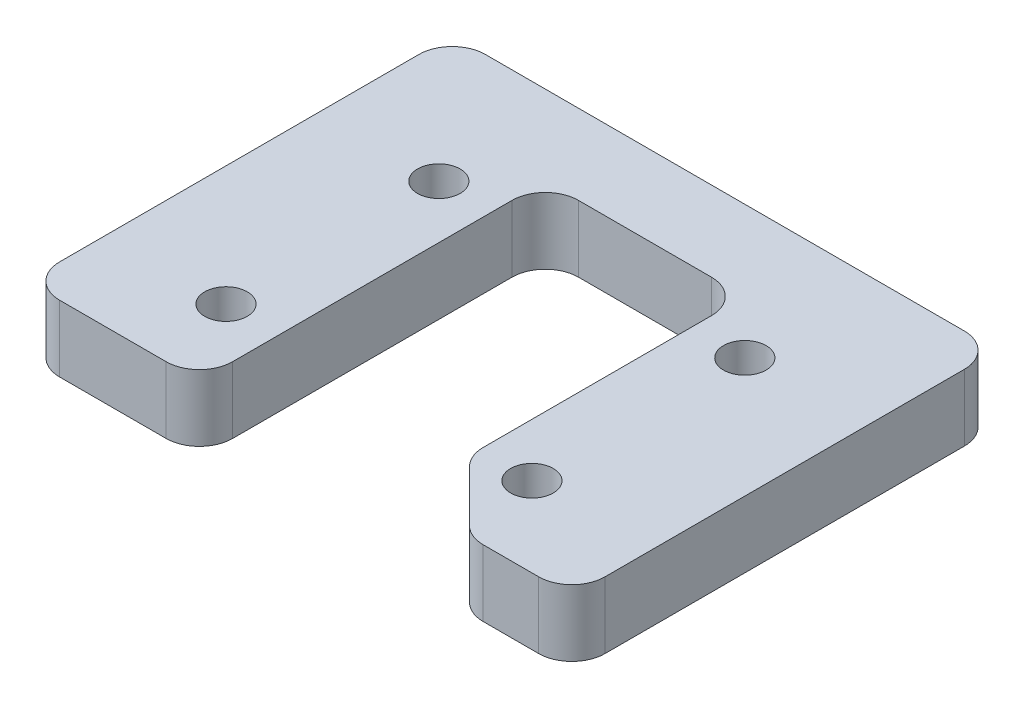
ISO-10303-21;
HEADER;
FILE_DESCRIPTION(('STEP AP214'),'2;1');
FILE_NAME('part.step','',(''),(''),'','','');
FILE_SCHEMA(('AUTOMOTIVE_DESIGN { 1 0 10303 214 1 1 1 1 }'));
ENDSEC;
DATA;
#1=APPLICATION_CONTEXT('core data for automotive mechanical design processes');
#2=APPLICATION_PROTOCOL_DEFINITION('international standard','automotive_design',2000,#1);
#3=PRODUCT_CONTEXT('',#1,'mechanical');
#4=PRODUCT('Part','Part','',(#3));
#5=PRODUCT_RELATED_PRODUCT_CATEGORY('part','',(#4));
#6=PRODUCT_DEFINITION_FORMATION('','',#4);
#7=PRODUCT_DEFINITION_CONTEXT('part definition',#1,'design');
#8=PRODUCT_DEFINITION('design','',#6,#7);
#9=PRODUCT_DEFINITION_SHAPE('','',#8);
#10=(LENGTH_UNIT() NAMED_UNIT(*) SI_UNIT(.MILLI.,.METRE.));
#11=(NAMED_UNIT(*) PLANE_ANGLE_UNIT() SI_UNIT($,.RADIAN.));
#12=(NAMED_UNIT(*) SI_UNIT($,.STERADIAN.) SOLID_ANGLE_UNIT());
#13=UNCERTAINTY_MEASURE_WITH_UNIT(LENGTH_MEASURE(1.E-05),#10,'distance_accuracy_value','');
#14=(GEOMETRIC_REPRESENTATION_CONTEXT(3) GLOBAL_UNCERTAINTY_ASSIGNED_CONTEXT((#13)) GLOBAL_UNIT_ASSIGNED_CONTEXT((#10,
#11,#12)) REPRESENTATION_CONTEXT('',''));
#15=CARTESIAN_POINT('',(0.,0.,0.));
#16=DIRECTION('',(0.,0.,1.));
#17=DIRECTION('',(1.,0.,0.));
#18=AXIS2_PLACEMENT_3D('',#15,#16,#17);
#19=CARTESIAN_POINT('',(-41.,10.,32.));
#20=DIRECTION('',(0.,0.,-1.));
#21=DIRECTION('',(-1.,0.,0.));
#22=AXIS2_PLACEMENT_3D('',#19,#20,#21);
#23=PLANE('',#22);
#24=DIRECTION('',(1.,0.,0.));
#25=VECTOR('',#24,1.);
#26=CARTESIAN_POINT('',(-41.,10.,32.));
#27=LINE('',#26,#25);
#28=CARTESIAN_POINT('',(-36.,10.,32.));
#29=VERTEX_POINT('',#28);
#30=CARTESIAN_POINT('',(-20.,10.,32.));
#31=VERTEX_POINT('',#30);
#32=EDGE_CURVE('E206',#29,#31,#27,.T.);
#33=ORIENTED_EDGE('',*,*,#32,.F.);
#34=DIRECTION('',(0.,-1.,0.));
#35=VECTOR('',#34,1.);
#36=CARTESIAN_POINT('',(-36.,10.,32.));
#37=LINE('',#36,#35);
#38=CARTESIAN_POINT('',(-36.,0.,32.));
#39=VERTEX_POINT('',#38);
#40=EDGE_CURVE('E168',#29,#39,#37,.T.);
#41=ORIENTED_EDGE('',*,*,#40,.T.);
#42=DIRECTION('',(1.,0.,0.));
#43=VECTOR('',#42,1.);
#44=CARTESIAN_POINT('',(-41.,0.,32.));
#45=LINE('',#44,#43);
#46=CARTESIAN_POINT('',(-20.,0.,32.));
#47=VERTEX_POINT('',#46);
#48=EDGE_CURVE('E199',#39,#47,#45,.T.);
#49=ORIENTED_EDGE('',*,*,#48,.T.);
#50=DIRECTION('',(0.,1.,0.));
#51=VECTOR('',#50,1.);
#52=CARTESIAN_POINT('',(-20.,10.,32.));
#53=LINE('',#52,#51);
#54=EDGE_CURVE('E277',#47,#31,#53,.T.);
#55=ORIENTED_EDGE('',*,*,#54,.T.);
#56=EDGE_LOOP('',(#33,#41,#49,#55));
#57=FACE_BOUND('',#56,.T.);
#58=ADVANCED_FACE('F32',(#57),#23,.F.);
#59=CARTESIAN_POINT('',(41.,10.,-32.));
#60=DIRECTION('',(-1.,0.,0.));
#61=DIRECTION('',(0.,0.,1.));
#62=AXIS2_PLACEMENT_3D('',#59,#60,#61);
#63=PLANE('',#62);
#64=DIRECTION('',(0.,0.,-1.));
#65=VECTOR('',#64,1.);
#66=CARTESIAN_POINT('',(41.,10.,-32.));
#67=LINE('',#66,#65);
#68=CARTESIAN_POINT('',(41.,10.,27.));
#69=VERTEX_POINT('',#68);
#70=CARTESIAN_POINT('',(41.,10.,-27.));
#71=VERTEX_POINT('',#70);
#72=EDGE_CURVE('E195',#69,#71,#67,.T.);
#73=ORIENTED_EDGE('',*,*,#72,.F.);
#74=DIRECTION('',(0.,-1.,0.));
#75=VECTOR('',#74,1.);
#76=CARTESIAN_POINT('',(41.,10.,27.));
#77=LINE('',#76,#75);
#78=CARTESIAN_POINT('',(41.,0.,27.));
#79=VERTEX_POINT('',#78);
#80=EDGE_CURVE('E264',#69,#79,#77,.T.);
#81=ORIENTED_EDGE('',*,*,#80,.T.);
#82=DIRECTION('',(0.,0.,-1.));
#83=VECTOR('',#82,1.);
#84=CARTESIAN_POINT('',(41.,0.,-32.));
#85=LINE('',#84,#83);
#86=CARTESIAN_POINT('',(41.,0.,-27.));
#87=VERTEX_POINT('',#86);
#88=EDGE_CURVE('E208',#79,#87,#85,.T.);
#89=ORIENTED_EDGE('',*,*,#88,.T.);
#90=DIRECTION('',(0.,-1.,0.));
#91=VECTOR('',#90,1.);
#92=CARTESIAN_POINT('',(41.,10.,-27.));
#93=LINE('',#92,#91);
#94=EDGE_CURVE('E262',#87,#71,#93,.F.);
#95=ORIENTED_EDGE('',*,*,#94,.T.);
#96=EDGE_LOOP('',(#73,#81,#89,#95));
#97=FACE_BOUND('',#96,.T.);
#98=ADVANCED_FACE('F370',(#97),#63,.F.);
#99=CARTESIAN_POINT('',(-41.,10.,-32.));
#100=DIRECTION('',(0.,0.,1.));
#101=DIRECTION('',(1.,0.,0.));
#102=AXIS2_PLACEMENT_3D('',#99,#100,#101);
#103=PLANE('',#102);
#104=DIRECTION('',(-1.,0.,0.));
#105=VECTOR('',#104,1.);
#106=CARTESIAN_POINT('',(-41.,10.,-32.));
#107=LINE('',#106,#105);
#108=CARTESIAN_POINT('',(36.,10.,-32.));
#109=VERTEX_POINT('',#108);
#110=CARTESIAN_POINT('',(-36.,10.,-32.));
#111=VERTEX_POINT('',#110);
#112=EDGE_CURVE('E198',#109,#111,#107,.T.);
#113=ORIENTED_EDGE('',*,*,#112,.F.);
#114=DIRECTION('',(0.,-1.,0.));
#115=VECTOR('',#114,1.);
#116=CARTESIAN_POINT('',(36.,10.,-32.));
#117=LINE('',#116,#115);
#118=CARTESIAN_POINT('',(36.,0.,-32.));
#119=VERTEX_POINT('',#118);
#120=EDGE_CURVE('E269',#109,#119,#117,.T.);
#121=ORIENTED_EDGE('',*,*,#120,.T.);
#122=DIRECTION('',(-1.,0.,0.));
#123=VECTOR('',#122,1.);
#124=CARTESIAN_POINT('',(-41.,0.,-32.));
#125=LINE('',#124,#123);
#126=CARTESIAN_POINT('',(-36.,0.,-32.));
#127=VERTEX_POINT('',#126);
#128=EDGE_CURVE('E211',#119,#127,#125,.T.);
#129=ORIENTED_EDGE('',*,*,#128,.T.);
#130=DIRECTION('',(0.,-1.,0.));
#131=VECTOR('',#130,1.);
#132=CARTESIAN_POINT('',(-36.,10.,-32.));
#133=LINE('',#132,#131);
#134=EDGE_CURVE('E267',#127,#111,#133,.F.);
#135=ORIENTED_EDGE('',*,*,#134,.T.);
#136=EDGE_LOOP('',(#113,#121,#129,#135));
#137=FACE_BOUND('',#136,.T.);
#138=ADVANCED_FACE('F376',(#137),#103,.F.);
#139=CARTESIAN_POINT('',(-41.,10.,-32.));
#140=DIRECTION('',(1.,0.,0.));
#141=DIRECTION('',(0.,0.,-1.));
#142=AXIS2_PLACEMENT_3D('',#139,#140,#141);
#143=PLANE('',#142);
#144=DIRECTION('',(0.,0.,1.));
#145=VECTOR('',#144,1.);
#146=CARTESIAN_POINT('',(-41.,10.,-32.));
#147=LINE('',#146,#145);
#148=CARTESIAN_POINT('',(-41.,10.,-27.));
#149=VERTEX_POINT('',#148);
#150=CARTESIAN_POINT('',(-41.,10.,27.));
#151=VERTEX_POINT('',#150);
#152=EDGE_CURVE('E202',#149,#151,#147,.T.);
#153=ORIENTED_EDGE('',*,*,#152,.F.);
#154=DIRECTION('',(0.,-1.,0.));
#155=VECTOR('',#154,1.);
#156=CARTESIAN_POINT('',(-41.,10.,-27.));
#157=LINE('',#156,#155);
#158=CARTESIAN_POINT('',(-41.,0.,-27.));
#159=VERTEX_POINT('',#158);
#160=EDGE_CURVE('E274',#149,#159,#157,.T.);
#161=ORIENTED_EDGE('',*,*,#160,.T.);
#162=DIRECTION('',(0.,0.,1.));
#163=VECTOR('',#162,1.);
#164=CARTESIAN_POINT('',(-41.,0.,-32.));
#165=LINE('',#164,#163);
#166=CARTESIAN_POINT('',(-41.,0.,27.));
#167=VERTEX_POINT('',#166);
#168=EDGE_CURVE('E214',#159,#167,#165,.T.);
#169=ORIENTED_EDGE('',*,*,#168,.T.);
#170=DIRECTION('',(0.,-1.,0.));
#171=VECTOR('',#170,1.);
#172=CARTESIAN_POINT('',(-41.,10.,27.));
#173=LINE('',#172,#171);
#174=EDGE_CURVE('E272',#167,#151,#173,.F.);
#175=ORIENTED_EDGE('',*,*,#174,.T.);
#176=EDGE_LOOP('',(#153,#161,#169,#175));
#177=FACE_BOUND('',#176,.T.);
#178=ADVANCED_FACE('F383',(#177),#143,.F.);
#179=CARTESIAN_POINT('',(27.6776695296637,10.,32.));
#180=VERTEX_POINT('',#179);
#181=CARTESIAN_POINT('',(36.,10.,32.));
#182=VERTEX_POINT('',#181);
#183=EDGE_CURVE('E205',#180,#182,#27,.T.);
#184=ORIENTED_EDGE('',*,*,#183,.F.);
#185=DIRECTION('',(0.,1.,0.));
#186=VECTOR('',#185,1.);
#187=CARTESIAN_POINT('',(27.6776695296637,10.,32.));
#188=LINE('',#187,#186);
#189=CARTESIAN_POINT('',(27.6776695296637,0.,32.));
#190=VERTEX_POINT('',#189);
#191=EDGE_CURVE('E54',#180,#190,#188,.F.);
#192=ORIENTED_EDGE('',*,*,#191,.T.);
#193=CARTESIAN_POINT('',(36.,0.,32.));
#194=VERTEX_POINT('',#193);
#195=EDGE_CURVE('E217',#190,#194,#45,.T.);
#196=ORIENTED_EDGE('',*,*,#195,.T.);
#197=DIRECTION('',(0.,-1.,0.));
#198=VECTOR('',#197,1.);
#199=CARTESIAN_POINT('',(36.,10.,32.));
#200=LINE('',#199,#198);
#201=EDGE_CURVE('E259',#194,#182,#200,.F.);
#202=ORIENTED_EDGE('',*,*,#201,.T.);
#203=EDGE_LOOP('',(#184,#192,#196,#202));
#204=FACE_BOUND('',#203,.T.);
#205=ADVANCED_FACE('F347',(#204),#23,.F.);
#206=CARTESIAN_POINT('',(41.,10.,32.));
#207=DIRECTION('',(0.,1.,0.));
#208=DIRECTION('',(0.,0.,1.));
#209=AXIS2_PLACEMENT_3D('',#206,#207,#208);
#210=PLANE('',#209);
#211=CARTESIAN_POINT('',(23.,10.,-12.));
#212=DIRECTION('',(0.,1.,0.));
#213=DIRECTION('',(0.,0.,1.));
#214=AXIS2_PLACEMENT_3D('',#211,#212,#213);
#215=CIRCLE('',#214,3.2);
#216=CARTESIAN_POINT('',(23.,10.,-8.8));
#217=VERTEX_POINT('',#216);
#218=EDGE_CURVE('E330',#217,#217,#215,.T.);
#219=ORIENTED_EDGE('',*,*,#218,.F.);
#220=EDGE_LOOP('',(#219));
#221=FACE_BOUND('',#220,.T.);
#222=CARTESIAN_POINT('',(23.,10.,20.));
#223=DIRECTION('',(0.,1.,0.));
#224=DIRECTION('',(0.,0.,1.));
#225=AXIS2_PLACEMENT_3D('',#222,#223,#224);
#226=CIRCLE('',#225,3.2);
#227=CARTESIAN_POINT('',(23.,10.,23.2));
#228=VERTEX_POINT('',#227);
#229=EDGE_CURVE('E324',#228,#228,#226,.T.);
#230=ORIENTED_EDGE('',*,*,#229,.F.);
#231=EDGE_LOOP('',(#230));
#232=FACE_BOUND('',#231,.T.);
#233=CARTESIAN_POINT('',(-23.,10.,20.));
#234=DIRECTION('',(0.,1.,0.));
#235=DIRECTION('',(0.,0.,1.));
#236=AXIS2_PLACEMENT_3D('',#233,#234,#235);
#237=CIRCLE('',#236,3.2);
#238=CARTESIAN_POINT('',(-23.,10.,23.2));
#239=VERTEX_POINT('',#238);
#240=EDGE_CURVE('E318',#239,#239,#237,.T.);
#241=ORIENTED_EDGE('',*,*,#240,.F.);
#242=EDGE_LOOP('',(#241));
#243=FACE_BOUND('',#242,.T.);
#244=CARTESIAN_POINT('',(-23.,10.,-12.));
#245=DIRECTION('',(0.,1.,0.));
#246=DIRECTION('',(0.,0.,1.));
#247=AXIS2_PLACEMENT_3D('',#244,#245,#246);
#248=CIRCLE('',#247,3.2);
#249=CARTESIAN_POINT('',(-23.,10.,-8.8));
#250=VERTEX_POINT('',#249);
#251=EDGE_CURVE('E310',#250,#250,#248,.T.);
#252=ORIENTED_EDGE('',*,*,#251,.F.);
#253=EDGE_LOOP('',(#252));
#254=FACE_BOUND('',#253,.T.);
#255=DIRECTION('',(0.,0.,-1.));
#256=VECTOR('',#255,1.);
#257=CARTESIAN_POINT('',(15.,10.,-20.));
#258=LINE('',#257,#256);
#259=CARTESIAN_POINT('',(15.,10.,19.3223304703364));
#260=VERTEX_POINT('',#259);
#261=CARTESIAN_POINT('',(15.,10.,-15.));
#262=VERTEX_POINT('',#261);
#263=EDGE_CURVE('E191',#260,#262,#258,.T.);
#264=ORIENTED_EDGE('',*,*,#263,.F.);
#265=CARTESIAN_POINT('',(20.,10.,19.3223304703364));
#266=DIRECTION('',(0.,1.,0.));
#267=DIRECTION('',(0.,0.,1.));
#268=AXIS2_PLACEMENT_3D('',#265,#266,#267);
#269=CIRCLE('',#268,5.);
#270=CARTESIAN_POINT('',(16.4644660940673,10.,22.8578643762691));
#271=VERTEX_POINT('',#270);
#272=EDGE_CURVE('E239',#260,#271,#269,.T.);
#273=ORIENTED_EDGE('',*,*,#272,.T.);
#274=DIRECTION('',(-0.707106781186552,0.,-0.707106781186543));
#275=VECTOR('',#274,1.);
#276=CARTESIAN_POINT('',(15.,10.,21.3933982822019));
#277=LINE('',#276,#275);
#278=CARTESIAN_POINT('',(24.142135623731,10.,30.5355339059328));
#279=VERTEX_POINT('',#278);
#280=EDGE_CURVE('E291',#279,#271,#277,.T.);
#281=ORIENTED_EDGE('',*,*,#280,.F.);
#282=CARTESIAN_POINT('',(27.6776695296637,10.,27.));
#283=DIRECTION('',(0.,1.,0.));
#284=DIRECTION('',(0.,0.,1.));
#285=AXIS2_PLACEMENT_3D('',#282,#283,#284);
#286=CIRCLE('',#285,5.);
#287=EDGE_CURVE('E237',#279,#180,#286,.T.);
#288=ORIENTED_EDGE('',*,*,#287,.T.);
#289=ORIENTED_EDGE('',*,*,#183,.T.);
#290=CARTESIAN_POINT('',(36.,10.,27.));
#291=DIRECTION('',(0.,1.,0.));
#292=DIRECTION('',(0.,0.,1.));
#293=AXIS2_PLACEMENT_3D('',#290,#291,#292);
#294=CIRCLE('',#293,5.);
#295=EDGE_CURVE('E235',#182,#69,#294,.T.);
#296=ORIENTED_EDGE('',*,*,#295,.T.);
#297=ORIENTED_EDGE('',*,*,#72,.T.);
#298=CARTESIAN_POINT('',(36.,10.,-27.));
#299=DIRECTION('',(0.,1.,0.));
#300=DIRECTION('',(0.,0.,1.));
#301=AXIS2_PLACEMENT_3D('',#298,#299,#300);
#302=CIRCLE('',#301,5.);
#303=EDGE_CURVE('E233',#71,#109,#302,.T.);
#304=ORIENTED_EDGE('',*,*,#303,.T.);
#305=ORIENTED_EDGE('',*,*,#112,.T.);
#306=CARTESIAN_POINT('',(-36.,10.,-27.));
#307=DIRECTION('',(0.,1.,0.));
#308=DIRECTION('',(0.,0.,1.));
#309=AXIS2_PLACEMENT_3D('',#306,#307,#308);
#310=CIRCLE('',#309,5.);
#311=EDGE_CURVE('E231',#111,#149,#310,.T.);
#312=ORIENTED_EDGE('',*,*,#311,.T.);
#313=ORIENTED_EDGE('',*,*,#152,.T.);
#314=CARTESIAN_POINT('',(-36.,10.,27.));
#315=DIRECTION('',(0.,1.,0.));
#316=DIRECTION('',(0.,0.,1.));
#317=AXIS2_PLACEMENT_3D('',#314,#315,#316);
#318=CIRCLE('',#317,5.);
#319=EDGE_CURVE('E229',#151,#29,#318,.T.);
#320=ORIENTED_EDGE('',*,*,#319,.T.);
#321=ORIENTED_EDGE('',*,*,#32,.T.);
#322=CARTESIAN_POINT('',(-20.,10.,27.));
#323=DIRECTION('',(0.,1.,0.));
#324=DIRECTION('',(0.,0.,1.));
#325=AXIS2_PLACEMENT_3D('',#322,#323,#324);
#326=CIRCLE('',#325,5.);
#327=CARTESIAN_POINT('',(-15.,10.,27.));
#328=VERTEX_POINT('',#327);
#329=EDGE_CURVE('E184',#31,#328,#326,.T.);
#330=ORIENTED_EDGE('',*,*,#329,.T.);
#331=DIRECTION('',(0.,0.,1.));
#332=VECTOR('',#331,1.);
#333=CARTESIAN_POINT('',(-15.,10.,-20.));
#334=LINE('',#333,#332);
#335=CARTESIAN_POINT('',(-15.,10.,-15.));
#336=VERTEX_POINT('',#335);
#337=EDGE_CURVE('E174',#336,#328,#334,.T.);
#338=ORIENTED_EDGE('',*,*,#337,.F.);
#339=CARTESIAN_POINT('',(-10.,10.,-15.));
#340=DIRECTION('',(0.,1.,0.));
#341=DIRECTION('',(0.,0.,1.));
#342=AXIS2_PLACEMENT_3D('',#339,#340,#341);
#343=CIRCLE('',#342,5.);
#344=CARTESIAN_POINT('',(-9.99999999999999,10.,-20.));
#345=VERTEX_POINT('',#344);
#346=EDGE_CURVE('E157',#336,#345,#343,.F.);
#347=ORIENTED_EDGE('',*,*,#346,.T.);
#348=DIRECTION('',(-1.,0.,0.));
#349=VECTOR('',#348,1.);
#350=CARTESIAN_POINT('',(15.,10.,-20.));
#351=LINE('',#350,#349);
#352=CARTESIAN_POINT('',(10.,10.,-20.));
#353=VERTEX_POINT('',#352);
#354=EDGE_CURVE('E186',#353,#345,#351,.T.);
#355=ORIENTED_EDGE('',*,*,#354,.F.);
#356=CARTESIAN_POINT('',(10.,10.,-15.));
#357=DIRECTION('',(0.,1.,0.));
#358=DIRECTION('',(0.,0.,1.));
#359=AXIS2_PLACEMENT_3D('',#356,#357,#358);
#360=CIRCLE('',#359,5.);
#361=EDGE_CURVE('E40',#353,#262,#360,.F.);
#362=ORIENTED_EDGE('',*,*,#361,.T.);
#363=EDGE_LOOP('',(#264,#273,#281,#288,#289,#296,#297,#304,#305,#312,#313,#320,#321,#330,#338,
#347,#355,#362));
#364=FACE_BOUND('',#363,.T.);
#365=ADVANCED_FACE('F182',(#221,#232,#243,#254,#364),#210,.T.);
#366=CARTESIAN_POINT('',(41.,0.,32.));
#367=DIRECTION('',(0.,1.,0.));
#368=DIRECTION('',(0.,0.,1.));
#369=AXIS2_PLACEMENT_3D('',#366,#367,#368);
#370=PLANE('',#369);
#371=CARTESIAN_POINT('',(23.,0.,-12.));
#372=DIRECTION('',(0.,1.,0.));
#373=DIRECTION('',(0.,0.,1.));
#374=AXIS2_PLACEMENT_3D('',#371,#372,#373);
#375=CIRCLE('',#374,3.2);
#376=CARTESIAN_POINT('',(23.,0.,-8.8));
#377=VERTEX_POINT('',#376);
#378=EDGE_CURVE('E327',#377,#377,#375,.T.);
#379=ORIENTED_EDGE('',*,*,#378,.T.);
#380=EDGE_LOOP('',(#379));
#381=FACE_BOUND('',#380,.T.);
#382=CARTESIAN_POINT('',(23.,0.,20.));
#383=DIRECTION('',(0.,1.,0.));
#384=DIRECTION('',(0.,0.,1.));
#385=AXIS2_PLACEMENT_3D('',#382,#383,#384);
#386=CIRCLE('',#385,3.2);
#387=CARTESIAN_POINT('',(23.,0.,23.2));
#388=VERTEX_POINT('',#387);
#389=EDGE_CURVE('E321',#388,#388,#386,.T.);
#390=ORIENTED_EDGE('',*,*,#389,.T.);
#391=EDGE_LOOP('',(#390));
#392=FACE_BOUND('',#391,.T.);
#393=CARTESIAN_POINT('',(-23.,0.,20.));
#394=DIRECTION('',(0.,1.,0.));
#395=DIRECTION('',(0.,0.,1.));
#396=AXIS2_PLACEMENT_3D('',#393,#394,#395);
#397=CIRCLE('',#396,3.2);
#398=CARTESIAN_POINT('',(-23.,0.,23.2));
#399=VERTEX_POINT('',#398);
#400=EDGE_CURVE('E315',#399,#399,#397,.T.);
#401=ORIENTED_EDGE('',*,*,#400,.T.);
#402=EDGE_LOOP('',(#401));
#403=FACE_BOUND('',#402,.T.);
#404=CARTESIAN_POINT('',(-23.,0.,-12.));
#405=DIRECTION('',(0.,1.,0.));
#406=DIRECTION('',(0.,0.,1.));
#407=AXIS2_PLACEMENT_3D('',#404,#405,#406);
#408=CIRCLE('',#407,3.2);
#409=CARTESIAN_POINT('',(-23.,0.,-8.8));
#410=VERTEX_POINT('',#409);
#411=EDGE_CURVE('E305',#410,#410,#408,.T.);
#412=ORIENTED_EDGE('',*,*,#411,.T.);
#413=EDGE_LOOP('',(#412));
#414=FACE_BOUND('',#413,.T.);
#415=DIRECTION('',(-0.707106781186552,0.,-0.707106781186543));
#416=VECTOR('',#415,1.);
#417=CARTESIAN_POINT('',(15.,0.,21.3933982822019));
#418=LINE('',#417,#416);
#419=CARTESIAN_POINT('',(24.142135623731,0.,30.5355339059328));
#420=VERTEX_POINT('',#419);
#421=CARTESIAN_POINT('',(16.4644660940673,0.,22.8578643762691));
#422=VERTEX_POINT('',#421);
#423=EDGE_CURVE('E185',#420,#422,#418,.T.);
#424=ORIENTED_EDGE('',*,*,#423,.T.);
#425=CARTESIAN_POINT('',(20.,0.,19.3223304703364));
#426=DIRECTION('',(0.,1.,0.));
#427=DIRECTION('',(0.,0.,1.));
#428=AXIS2_PLACEMENT_3D('',#425,#426,#427);
#429=CIRCLE('',#428,5.);
#430=CARTESIAN_POINT('',(15.,0.,19.3223304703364));
#431=VERTEX_POINT('',#430);
#432=EDGE_CURVE('E257',#422,#431,#429,.F.);
#433=ORIENTED_EDGE('',*,*,#432,.T.);
#434=DIRECTION('',(0.,0.,-1.));
#435=VECTOR('',#434,1.);
#436=CARTESIAN_POINT('',(15.,0.,-20.));
#437=LINE('',#436,#435);
#438=CARTESIAN_POINT('',(15.,0.,-15.));
#439=VERTEX_POINT('',#438);
#440=EDGE_CURVE('E189',#431,#439,#437,.T.);
#441=ORIENTED_EDGE('',*,*,#440,.T.);
#442=CARTESIAN_POINT('',(10.,0.,-15.));
#443=DIRECTION('',(0.,1.,0.));
#444=DIRECTION('',(0.,0.,1.));
#445=AXIS2_PLACEMENT_3D('',#442,#443,#444);
#446=CIRCLE('',#445,5.);
#447=CARTESIAN_POINT('',(10.,0.,-20.));
#448=VERTEX_POINT('',#447);
#449=EDGE_CURVE('E11',#439,#448,#446,.T.);
#450=ORIENTED_EDGE('',*,*,#449,.T.);
#451=DIRECTION('',(-1.,0.,0.));
#452=VECTOR('',#451,1.);
#453=CARTESIAN_POINT('',(15.,0.,-20.));
#454=LINE('',#453,#452);
#455=CARTESIAN_POINT('',(-9.99999999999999,0.,-20.));
#456=VERTEX_POINT('',#455);
#457=EDGE_CURVE('E297',#448,#456,#454,.T.);
#458=ORIENTED_EDGE('',*,*,#457,.T.);
#459=CARTESIAN_POINT('',(-10.,0.,-15.));
#460=DIRECTION('',(0.,1.,0.));
#461=DIRECTION('',(0.,0.,1.));
#462=AXIS2_PLACEMENT_3D('',#459,#460,#461);
#463=CIRCLE('',#462,5.);
#464=CARTESIAN_POINT('',(-15.,0.,-15.));
#465=VERTEX_POINT('',#464);
#466=EDGE_CURVE('E167',#456,#465,#463,.T.);
#467=ORIENTED_EDGE('',*,*,#466,.T.);
#468=DIRECTION('',(0.,0.,1.));
#469=VECTOR('',#468,1.);
#470=CARTESIAN_POINT('',(-15.,0.,-20.));
#471=LINE('',#470,#469);
#472=CARTESIAN_POINT('',(-15.,0.,27.));
#473=VERTEX_POINT('',#472);
#474=EDGE_CURVE('E177',#465,#473,#471,.T.);
#475=ORIENTED_EDGE('',*,*,#474,.T.);
#476=CARTESIAN_POINT('',(-20.,0.,27.));
#477=DIRECTION('',(0.,1.,0.));
#478=DIRECTION('',(0.,0.,1.));
#479=AXIS2_PLACEMENT_3D('',#476,#477,#478);
#480=CIRCLE('',#479,5.);
#481=EDGE_CURVE('E246',#473,#47,#480,.F.);
#482=ORIENTED_EDGE('',*,*,#481,.T.);
#483=ORIENTED_EDGE('',*,*,#48,.F.);
#484=CARTESIAN_POINT('',(-36.,0.,27.));
#485=DIRECTION('',(0.,1.,0.));
#486=DIRECTION('',(0.,0.,1.));
#487=AXIS2_PLACEMENT_3D('',#484,#485,#486);
#488=CIRCLE('',#487,5.);
#489=EDGE_CURVE('E248',#39,#167,#488,.F.);
#490=ORIENTED_EDGE('',*,*,#489,.T.);
#491=ORIENTED_EDGE('',*,*,#168,.F.);
#492=CARTESIAN_POINT('',(-36.,0.,-27.));
#493=DIRECTION('',(0.,1.,0.));
#494=DIRECTION('',(0.,0.,1.));
#495=AXIS2_PLACEMENT_3D('',#492,#493,#494);
#496=CIRCLE('',#495,5.);
#497=EDGE_CURVE('E250',#159,#127,#496,.F.);
#498=ORIENTED_EDGE('',*,*,#497,.T.);
#499=ORIENTED_EDGE('',*,*,#128,.F.);
#500=CARTESIAN_POINT('',(36.,0.,-27.));
#501=DIRECTION('',(0.,1.,0.));
#502=DIRECTION('',(0.,0.,1.));
#503=AXIS2_PLACEMENT_3D('',#500,#501,#502);
#504=CIRCLE('',#503,5.);
#505=EDGE_CURVE('E252',#119,#87,#504,.F.);
#506=ORIENTED_EDGE('',*,*,#505,.T.);
#507=ORIENTED_EDGE('',*,*,#88,.F.);
#508=CARTESIAN_POINT('',(36.,0.,27.));
#509=DIRECTION('',(0.,1.,0.));
#510=DIRECTION('',(0.,0.,1.));
#511=AXIS2_PLACEMENT_3D('',#508,#509,#510);
#512=CIRCLE('',#511,5.);
#513=EDGE_CURVE('E47',#79,#194,#512,.F.);
#514=ORIENTED_EDGE('',*,*,#513,.T.);
#515=ORIENTED_EDGE('',*,*,#195,.F.);
#516=CARTESIAN_POINT('',(27.6776695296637,0.,27.));
#517=DIRECTION('',(0.,1.,0.));
#518=DIRECTION('',(0.,0.,1.));
#519=AXIS2_PLACEMENT_3D('',#516,#517,#518);
#520=CIRCLE('',#519,5.);
#521=EDGE_CURVE('E255',#190,#420,#520,.F.);
#522=ORIENTED_EDGE('',*,*,#521,.T.);
#523=EDGE_LOOP('',(#424,#433,#441,#450,#458,#467,#475,#482,#483,#490,#491,#498,#499,#506,#507,
#514,#515,#522));
#524=FACE_BOUND('',#523,.T.);
#525=ADVANCED_FACE('F296',(#381,#392,#403,#414,#524),#370,.F.);
#526=CARTESIAN_POINT('',(-15.,0.,-20.));
#527=DIRECTION('',(-1.,0.,0.));
#528=DIRECTION('',(0.,0.,1.));
#529=AXIS2_PLACEMENT_3D('',#526,#527,#528);
#530=PLANE('',#529);
#531=ORIENTED_EDGE('',*,*,#474,.F.);
#532=DIRECTION('',(0.,1.,0.));
#533=VECTOR('',#532,1.);
#534=CARTESIAN_POINT('',(-15.,10.,-15.));
#535=LINE('',#534,#533);
#536=EDGE_CURVE('E161',#465,#336,#535,.T.);
#537=ORIENTED_EDGE('',*,*,#536,.T.);
#538=ORIENTED_EDGE('',*,*,#337,.T.);
#539=DIRECTION('',(0.,1.,0.));
#540=VECTOR('',#539,1.);
#541=CARTESIAN_POINT('',(-15.,0.,27.));
#542=LINE('',#541,#540);
#543=EDGE_CURVE('E179',#328,#473,#542,.F.);
#544=ORIENTED_EDGE('',*,*,#543,.T.);
#545=EDGE_LOOP('',(#531,#537,#538,#544));
#546=FACE_BOUND('',#545,.T.);
#547=ADVANCED_FACE('F173',(#546),#530,.F.);
#548=CARTESIAN_POINT('',(15.,0.,-20.));
#549=DIRECTION('',(0.,0.,-1.));
#550=DIRECTION('',(-1.,0.,0.));
#551=AXIS2_PLACEMENT_3D('',#548,#549,#550);
#552=PLANE('',#551);
#553=ORIENTED_EDGE('',*,*,#354,.T.);
#554=DIRECTION('',(0.,1.,0.));
#555=VECTOR('',#554,1.);
#556=CARTESIAN_POINT('',(-10.,0.,-20.));
#557=LINE('',#556,#555);
#558=EDGE_CURVE('E162',#345,#456,#557,.F.);
#559=ORIENTED_EDGE('',*,*,#558,.T.);
#560=ORIENTED_EDGE('',*,*,#457,.F.);
#561=DIRECTION('',(0.,1.,0.));
#562=VECTOR('',#561,1.);
#563=CARTESIAN_POINT('',(10.,10.,-20.));
#564=LINE('',#563,#562);
#565=EDGE_CURVE('E178',#448,#353,#564,.T.);
#566=ORIENTED_EDGE('',*,*,#565,.T.);
#567=EDGE_LOOP('',(#553,#559,#560,#566));
#568=FACE_BOUND('',#567,.T.);
#569=ADVANCED_FACE('F299',(#568),#552,.F.);
#570=CARTESIAN_POINT('',(15.,0.,-20.));
#571=DIRECTION('',(1.,0.,0.));
#572=DIRECTION('',(0.,0.,-1.));
#573=AXIS2_PLACEMENT_3D('',#570,#571,#572);
#574=PLANE('',#573);
#575=ORIENTED_EDGE('',*,*,#263,.T.);
#576=DIRECTION('',(0.,1.,0.));
#577=VECTOR('',#576,1.);
#578=CARTESIAN_POINT('',(15.,0.,-15.));
#579=LINE('',#578,#577);
#580=EDGE_CURVE('E226',#262,#439,#579,.F.);
#581=ORIENTED_EDGE('',*,*,#580,.T.);
#582=ORIENTED_EDGE('',*,*,#440,.F.);
#583=DIRECTION('',(0.,1.,0.));
#584=VECTOR('',#583,1.);
#585=CARTESIAN_POINT('',(15.,0.,19.3223304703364));
#586=LINE('',#585,#584);
#587=EDGE_CURVE('E223',#431,#260,#586,.T.);
#588=ORIENTED_EDGE('',*,*,#587,.T.);
#589=EDGE_LOOP('',(#575,#581,#582,#588));
#590=FACE_BOUND('',#589,.T.);
#591=ADVANCED_FACE('F287',(#590),#574,.F.);
#592=CARTESIAN_POINT('',(15.,0.,21.3933982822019));
#593=DIRECTION('',(0.707106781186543,0.,-0.707106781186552));
#594=DIRECTION('',(-0.707106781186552,0.,-0.707106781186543));
#595=AXIS2_PLACEMENT_3D('',#592,#593,#594);
#596=PLANE('',#595);
#597=ORIENTED_EDGE('',*,*,#280,.T.);
#598=DIRECTION('',(0.,1.,0.));
#599=VECTOR('',#598,1.);
#600=CARTESIAN_POINT('',(16.4644660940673,0.,22.8578643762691));
#601=LINE('',#600,#599);
#602=EDGE_CURVE('E244',#271,#422,#601,.F.);
#603=ORIENTED_EDGE('',*,*,#602,.T.);
#604=ORIENTED_EDGE('',*,*,#423,.F.);
#605=DIRECTION('',(0.,1.,0.));
#606=VECTOR('',#605,1.);
#607=CARTESIAN_POINT('',(24.142135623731,0.,30.5355339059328));
#608=LINE('',#607,#606);
#609=EDGE_CURVE('E241',#420,#279,#608,.T.);
#610=ORIENTED_EDGE('',*,*,#609,.T.);
#611=EDGE_LOOP('',(#597,#603,#604,#610));
#612=FACE_BOUND('',#611,.T.);
#613=ADVANCED_FACE('F358',(#612),#596,.F.);
#614=CARTESIAN_POINT('',(-23.,0.,-12.));
#615=DIRECTION('',(0.,1.,0.));
#616=DIRECTION('',(0.,0.,1.));
#617=AXIS2_PLACEMENT_3D('',#614,#615,#616);
#618=CYLINDRICAL_SURFACE('',#617,3.2);
#619=ORIENTED_EDGE('',*,*,#411,.F.);
#620=EDGE_LOOP('',(#619));
#621=FACE_BOUND('',#620,.T.);
#622=ORIENTED_EDGE('',*,*,#251,.T.);
#623=EDGE_LOOP('',(#622));
#624=FACE_BOUND('',#623,.T.);
#625=ADVANCED_FACE('F355',(#621,#624),#618,.F.);
#626=CARTESIAN_POINT('',(-23.,0.,20.));
#627=DIRECTION('',(0.,1.,0.));
#628=DIRECTION('',(0.,0.,1.));
#629=AXIS2_PLACEMENT_3D('',#626,#627,#628);
#630=CYLINDRICAL_SURFACE('',#629,3.2);
#631=ORIENTED_EDGE('',*,*,#400,.F.);
#632=EDGE_LOOP('',(#631));
#633=FACE_BOUND('',#632,.T.);
#634=ORIENTED_EDGE('',*,*,#240,.T.);
#635=EDGE_LOOP('',(#634));
#636=FACE_BOUND('',#635,.T.);
#637=ADVANCED_FACE('F357',(#633,#636),#630,.F.);
#638=CARTESIAN_POINT('',(23.,0.,20.));
#639=DIRECTION('',(0.,1.,0.));
#640=DIRECTION('',(0.,0.,1.));
#641=AXIS2_PLACEMENT_3D('',#638,#639,#640);
#642=CYLINDRICAL_SURFACE('',#641,3.2);
#643=ORIENTED_EDGE('',*,*,#389,.F.);
#644=EDGE_LOOP('',(#643));
#645=FACE_BOUND('',#644,.T.);
#646=ORIENTED_EDGE('',*,*,#229,.T.);
#647=EDGE_LOOP('',(#646));
#648=FACE_BOUND('',#647,.T.);
#649=ADVANCED_FACE('F341',(#645,#648),#642,.F.);
#650=CARTESIAN_POINT('',(23.,0.,-12.));
#651=DIRECTION('',(0.,1.,0.));
#652=DIRECTION('',(0.,0.,1.));
#653=AXIS2_PLACEMENT_3D('',#650,#651,#652);
#654=CYLINDRICAL_SURFACE('',#653,3.2);
#655=ORIENTED_EDGE('',*,*,#378,.F.);
#656=EDGE_LOOP('',(#655));
#657=FACE_BOUND('',#656,.T.);
#658=ORIENTED_EDGE('',*,*,#218,.T.);
#659=EDGE_LOOP('',(#658));
#660=FACE_BOUND('',#659,.T.);
#661=ADVANCED_FACE('F338',(#657,#660),#654,.F.);
#662=CARTESIAN_POINT('',(-10.,0.,-15.));
#663=DIRECTION('',(0.,-1.,0.));
#664=DIRECTION('',(0.,0.,-1.));
#665=AXIS2_PLACEMENT_3D('',#662,#663,#664);
#666=CYLINDRICAL_SURFACE('',#665,5.);
#667=ORIENTED_EDGE('',*,*,#466,.F.);
#668=ORIENTED_EDGE('',*,*,#558,.F.);
#669=ORIENTED_EDGE('',*,*,#346,.F.);
#670=ORIENTED_EDGE('',*,*,#536,.F.);
#671=EDGE_LOOP('',(#667,#668,#669,#670));
#672=FACE_BOUND('',#671,.T.);
#673=ADVANCED_FACE('F160',(#672),#666,.F.);
#674=CARTESIAN_POINT('',(10.,0.,-15.));
#675=DIRECTION('',(0.,-1.,0.));
#676=DIRECTION('',(0.,0.,-1.));
#677=AXIS2_PLACEMENT_3D('',#674,#675,#676);
#678=CYLINDRICAL_SURFACE('',#677,5.);
#679=ORIENTED_EDGE('',*,*,#449,.F.);
#680=ORIENTED_EDGE('',*,*,#580,.F.);
#681=ORIENTED_EDGE('',*,*,#361,.F.);
#682=ORIENTED_EDGE('',*,*,#565,.F.);
#683=EDGE_LOOP('',(#679,#680,#681,#682));
#684=FACE_BOUND('',#683,.T.);
#685=ADVANCED_FACE('F293',(#684),#678,.F.);
#686=CARTESIAN_POINT('',(20.,0.,19.3223304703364));
#687=DIRECTION('',(0.,1.,0.));
#688=DIRECTION('',(0.,0.,1.));
#689=AXIS2_PLACEMENT_3D('',#686,#687,#688);
#690=CYLINDRICAL_SURFACE('',#689,5.);
#691=ORIENTED_EDGE('',*,*,#432,.F.);
#692=ORIENTED_EDGE('',*,*,#602,.F.);
#693=ORIENTED_EDGE('',*,*,#272,.F.);
#694=ORIENTED_EDGE('',*,*,#587,.F.);
#695=EDGE_LOOP('',(#691,#692,#693,#694));
#696=FACE_BOUND('',#695,.T.);
#697=ADVANCED_FACE('F398',(#696),#690,.T.);
#698=CARTESIAN_POINT('',(27.6776695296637,0.,27.));
#699=DIRECTION('',(0.,1.,0.));
#700=DIRECTION('',(0.,0.,1.));
#701=AXIS2_PLACEMENT_3D('',#698,#699,#700);
#702=CYLINDRICAL_SURFACE('',#701,5.);
#703=ORIENTED_EDGE('',*,*,#521,.F.);
#704=ORIENTED_EDGE('',*,*,#191,.F.);
#705=ORIENTED_EDGE('',*,*,#287,.F.);
#706=ORIENTED_EDGE('',*,*,#609,.F.);
#707=EDGE_LOOP('',(#703,#704,#705,#706));
#708=FACE_BOUND('',#707,.T.);
#709=ADVANCED_FACE('F393',(#708),#702,.T.);
#710=CARTESIAN_POINT('',(36.,10.,27.));
#711=DIRECTION('',(0.,-1.,0.));
#712=DIRECTION('',(0.,0.,-1.));
#713=AXIS2_PLACEMENT_3D('',#710,#711,#712);
#714=CYLINDRICAL_SURFACE('',#713,5.);
#715=ORIENTED_EDGE('',*,*,#295,.F.);
#716=ORIENTED_EDGE('',*,*,#201,.F.);
#717=ORIENTED_EDGE('',*,*,#513,.F.);
#718=ORIENTED_EDGE('',*,*,#80,.F.);
#719=EDGE_LOOP('',(#715,#716,#717,#718));
#720=FACE_BOUND('',#719,.T.);
#721=ADVANCED_FACE('F405',(#720),#714,.T.);
#722=CARTESIAN_POINT('',(36.,10.,-27.));
#723=DIRECTION('',(0.,-1.,0.));
#724=DIRECTION('',(0.,0.,-1.));
#725=AXIS2_PLACEMENT_3D('',#722,#723,#724);
#726=CYLINDRICAL_SURFACE('',#725,5.);
#727=ORIENTED_EDGE('',*,*,#303,.F.);
#728=ORIENTED_EDGE('',*,*,#94,.F.);
#729=ORIENTED_EDGE('',*,*,#505,.F.);
#730=ORIENTED_EDGE('',*,*,#120,.F.);
#731=EDGE_LOOP('',(#727,#728,#729,#730));
#732=FACE_BOUND('',#731,.T.);
#733=ADVANCED_FACE('F412',(#732),#726,.T.);
#734=CARTESIAN_POINT('',(-36.,10.,-27.));
#735=DIRECTION('',(0.,-1.,0.));
#736=DIRECTION('',(0.,0.,-1.));
#737=AXIS2_PLACEMENT_3D('',#734,#735,#736);
#738=CYLINDRICAL_SURFACE('',#737,5.);
#739=ORIENTED_EDGE('',*,*,#311,.F.);
#740=ORIENTED_EDGE('',*,*,#134,.F.);
#741=ORIENTED_EDGE('',*,*,#497,.F.);
#742=ORIENTED_EDGE('',*,*,#160,.F.);
#743=EDGE_LOOP('',(#739,#740,#741,#742));
#744=FACE_BOUND('',#743,.T.);
#745=ADVANCED_FACE('F416',(#744),#738,.T.);
#746=CARTESIAN_POINT('',(-36.,10.,27.));
#747=DIRECTION('',(0.,-1.,0.));
#748=DIRECTION('',(0.,0.,-1.));
#749=AXIS2_PLACEMENT_3D('',#746,#747,#748);
#750=CYLINDRICAL_SURFACE('',#749,5.);
#751=ORIENTED_EDGE('',*,*,#319,.F.);
#752=ORIENTED_EDGE('',*,*,#174,.F.);
#753=ORIENTED_EDGE('',*,*,#489,.F.);
#754=ORIENTED_EDGE('',*,*,#40,.F.);
#755=EDGE_LOOP('',(#751,#752,#753,#754));
#756=FACE_BOUND('',#755,.T.);
#757=ADVANCED_FACE('F419',(#756),#750,.T.);
#758=CARTESIAN_POINT('',(-20.,10.,27.));
#759=DIRECTION('',(0.,1.,0.));
#760=DIRECTION('',(0.,0.,1.));
#761=AXIS2_PLACEMENT_3D('',#758,#759,#760);
#762=CYLINDRICAL_SURFACE('',#761,5.);
#763=ORIENTED_EDGE('',*,*,#481,.F.);
#764=ORIENTED_EDGE('',*,*,#543,.F.);
#765=ORIENTED_EDGE('',*,*,#329,.F.);
#766=ORIENTED_EDGE('',*,*,#54,.F.);
#767=EDGE_LOOP('',(#763,#764,#765,#766));
#768=FACE_BOUND('',#767,.T.);
#769=ADVANCED_FACE('F34',(#768),#762,.T.);
#770=CLOSED_SHELL('',(#58,#98,#138,#178,#205,#365,#525,#547,#569,#591,#613,#625,#637,#649,#661,
#673,#685,#697,#709,#721,#733,#745,#757,#769));
#771=MANIFOLD_SOLID_BREP('B2',#770);
#772=ADVANCED_BREP_SHAPE_REPRESENTATION('',(#18,#771),#14);
#773=SHAPE_DEFINITION_REPRESENTATION(#9,#772);
ENDSEC;
END-ISO-10303-21;
